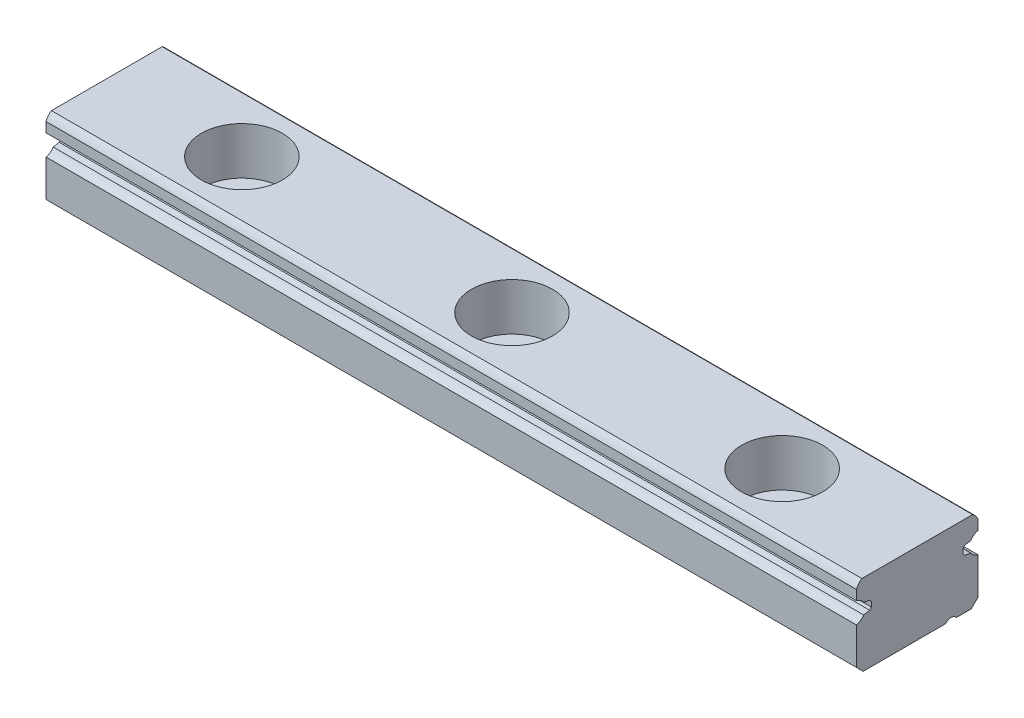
ISO-10303-21;
HEADER;
FILE_DESCRIPTION(('STEP AP214'),'2;1');
FILE_NAME('part.step','',(''),(''),'','','');
FILE_SCHEMA(('AUTOMOTIVE_DESIGN { 1 0 10303 214 1 1 1 1 }'));
ENDSEC;
DATA;
#1=APPLICATION_CONTEXT('core data for automotive mechanical design processes');
#2=APPLICATION_PROTOCOL_DEFINITION('international standard','automotive_design',2000,#1);
#3=PRODUCT_CONTEXT('',#1,'mechanical');
#4=PRODUCT('Part','Part','',(#3));
#5=PRODUCT_RELATED_PRODUCT_CATEGORY('part','',(#4));
#6=PRODUCT_DEFINITION_FORMATION('','',#4);
#7=PRODUCT_DEFINITION_CONTEXT('part definition',#1,'design');
#8=PRODUCT_DEFINITION('design','',#6,#7);
#9=PRODUCT_DEFINITION_SHAPE('','',#8);
#10=(LENGTH_UNIT() NAMED_UNIT(*) SI_UNIT(.MILLI.,.METRE.));
#11=(NAMED_UNIT(*) PLANE_ANGLE_UNIT() SI_UNIT($,.RADIAN.));
#12=(NAMED_UNIT(*) SI_UNIT($,.STERADIAN.) SOLID_ANGLE_UNIT());
#13=UNCERTAINTY_MEASURE_WITH_UNIT(LENGTH_MEASURE(1.E-05),#10,'distance_accuracy_value','');
#14=(GEOMETRIC_REPRESENTATION_CONTEXT(3) GLOBAL_UNCERTAINTY_ASSIGNED_CONTEXT((#13)) GLOBAL_UNIT_ASSIGNED_CONTEXT((#10,
#11,#12)) REPRESENTATION_CONTEXT('',''));
#15=CARTESIAN_POINT('',(0.,0.,0.));
#16=DIRECTION('',(0.,0.,1.));
#17=DIRECTION('',(1.,0.,0.));
#18=AXIS2_PLACEMENT_3D('',#15,#16,#17);
#19=CARTESIAN_POINT('',(-10.,4.17435595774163,-3.4));
#20=DIRECTION('',(0.,0.,-1.));
#21=DIRECTION('',(-1.,0.,0.));
#22=AXIS2_PLACEMENT_3D('',#19,#20,#21);
#23=PLANE('',#22);
#24=DIRECTION('',(0.,1.,0.));
#25=VECTOR('',#24,1.);
#26=CARTESIAN_POINT('',(-10.,4.17435595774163,-3.4));
#27=LINE('',#26,#25);
#28=CARTESIAN_POINT('',(-10.,3.82564404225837,-3.4));
#29=VERTEX_POINT('',#28);
#30=CARTESIAN_POINT('',(-10.,4.17435595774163,-3.4));
#31=VERTEX_POINT('',#30);
#32=EDGE_CURVE('E210',#29,#31,#27,.T.);
#33=ORIENTED_EDGE('',*,*,#32,.T.);
#34=DIRECTION('',(-1.,0.,0.));
#35=VECTOR('',#34,1.);
#36=CARTESIAN_POINT('',(-10.,4.17435595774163,-3.4));
#37=LINE('',#36,#35);
#38=CARTESIAN_POINT('',(50.,4.17435595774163,-3.4));
#39=VERTEX_POINT('',#38);
#40=EDGE_CURVE('E180',#31,#39,#37,.F.);
#41=ORIENTED_EDGE('',*,*,#40,.T.);
#42=DIRECTION('',(0.,1.,0.));
#43=VECTOR('',#42,1.);
#44=CARTESIAN_POINT('',(50.,4.17435595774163,-3.4));
#45=LINE('',#44,#43);
#46=CARTESIAN_POINT('',(50.,3.82564404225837,-3.4));
#47=VERTEX_POINT('',#46);
#48=EDGE_CURVE('E222',#39,#47,#45,.F.);
#49=ORIENTED_EDGE('',*,*,#48,.T.);
#50=DIRECTION('',(-1.,0.,0.));
#51=VECTOR('',#50,1.);
#52=CARTESIAN_POINT('',(-10.,3.82564404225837,-3.4));
#53=LINE('',#52,#51);
#54=EDGE_CURVE('E217',#47,#29,#53,.T.);
#55=ORIENTED_EDGE('',*,*,#54,.T.);
#56=EDGE_LOOP('',(#33,#41,#49,#55));
#57=FACE_BOUND('',#56,.T.);
#58=ADVANCED_FACE('F15',(#57),#23,.T.);
#59=CARTESIAN_POINT('',(-10.,3.82564404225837,3.4));
#60=DIRECTION('',(0.,0.,1.));
#61=DIRECTION('',(1.,0.,0.));
#62=AXIS2_PLACEMENT_3D('',#59,#60,#61);
#63=PLANE('',#62);
#64=DIRECTION('',(0.,1.,0.));
#65=VECTOR('',#64,1.);
#66=CARTESIAN_POINT('',(-10.,3.82564404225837,3.4));
#67=LINE('',#66,#65);
#68=CARTESIAN_POINT('',(-10.,4.17435595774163,3.4));
#69=VERTEX_POINT('',#68);
#70=CARTESIAN_POINT('',(-10.,3.82564404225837,3.4));
#71=VERTEX_POINT('',#70);
#72=EDGE_CURVE('E182',#69,#71,#67,.F.);
#73=ORIENTED_EDGE('',*,*,#72,.T.);
#74=DIRECTION('',(-1.,0.,0.));
#75=VECTOR('',#74,1.);
#76=CARTESIAN_POINT('',(-10.,3.82564404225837,3.4));
#77=LINE('',#76,#75);
#78=CARTESIAN_POINT('',(50.,3.82564404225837,3.4));
#79=VERTEX_POINT('',#78);
#80=EDGE_CURVE('E213',#71,#79,#77,.F.);
#81=ORIENTED_EDGE('',*,*,#80,.T.);
#82=DIRECTION('',(0.,1.,0.));
#83=VECTOR('',#82,1.);
#84=CARTESIAN_POINT('',(50.,3.82564404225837,3.4));
#85=LINE('',#84,#83);
#86=CARTESIAN_POINT('',(50.,4.17435595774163,3.4));
#87=VERTEX_POINT('',#86);
#88=EDGE_CURVE('E208',#79,#87,#85,.T.);
#89=ORIENTED_EDGE('',*,*,#88,.T.);
#90=DIRECTION('',(-1.,0.,0.));
#91=VECTOR('',#90,1.);
#92=CARTESIAN_POINT('',(-10.,4.17435595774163,3.4));
#93=LINE('',#92,#91);
#94=EDGE_CURVE('E203',#87,#69,#93,.T.);
#95=ORIENTED_EDGE('',*,*,#94,.T.);
#96=EDGE_LOOP('',(#73,#81,#89,#95));
#97=FACE_BOUND('',#96,.T.);
#98=ADVANCED_FACE('F928',(#97),#63,.T.);
#99=CARTESIAN_POINT('',(-10.,3.99999999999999,-3.76));
#100=DIRECTION('',(-1.,0.,0.));
#101=DIRECTION('',(0.,0.,1.));
#102=AXIS2_PLACEMENT_3D('',#99,#100,#101);
#103=CYLINDRICAL_SURFACE('',#102,0.400000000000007);
#104=ORIENTED_EDGE('',*,*,#40,.F.);
#105=CARTESIAN_POINT('',(-10.,3.99999999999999,-3.76));
#106=DIRECTION('',(-1.,0.,0.));
#107=DIRECTION('',(0.,0.,1.));
#108=AXIS2_PLACEMENT_3D('',#105,#106,#107);
#109=CIRCLE('',#108,0.400000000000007);
#110=CARTESIAN_POINT('',(-10.,4.32,-3.52));
#111=VERTEX_POINT('',#110);
#112=EDGE_CURVE('E19',#111,#31,#109,.F.);
#113=ORIENTED_EDGE('',*,*,#112,.F.);
#114=DIRECTION('',(1.,0.,0.));
#115=VECTOR('',#114,1.);
#116=CARTESIAN_POINT('',(-10.,4.32,-3.52));
#117=LINE('',#116,#115);
#118=CARTESIAN_POINT('',(50.,4.32,-3.52));
#119=VERTEX_POINT('',#118);
#120=EDGE_CURVE('E177',#119,#111,#117,.F.);
#121=ORIENTED_EDGE('',*,*,#120,.F.);
#122=CARTESIAN_POINT('',(50.,3.99999999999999,-3.76));
#123=DIRECTION('',(-1.,0.,0.));
#124=DIRECTION('',(0.,0.,1.));
#125=AXIS2_PLACEMENT_3D('',#122,#123,#124);
#126=CIRCLE('',#125,0.400000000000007);
#127=EDGE_CURVE('E221',#39,#119,#126,.T.);
#128=ORIENTED_EDGE('',*,*,#127,.F.);
#129=EDGE_LOOP('',(#104,#113,#121,#128));
#130=FACE_BOUND('',#129,.T.);
#131=ADVANCED_FACE('F174',(#130),#103,.F.);
#132=CARTESIAN_POINT('',(-10.,4.,-3.76));
#133=DIRECTION('',(-1.,0.,0.));
#134=DIRECTION('',(0.,0.,1.));
#135=AXIS2_PLACEMENT_3D('',#132,#133,#134);
#136=CYLINDRICAL_SURFACE('',#135,0.4);
#137=DIRECTION('',(1.,0.,0.));
#138=VECTOR('',#137,1.);
#139=CARTESIAN_POINT('',(-10.,3.68,-3.52));
#140=LINE('',#139,#138);
#141=CARTESIAN_POINT('',(-10.,3.68,-3.52));
#142=VERTEX_POINT('',#141);
#143=CARTESIAN_POINT('',(50.,3.68,-3.52));
#144=VERTEX_POINT('',#143);
#145=EDGE_CURVE('E201',#142,#144,#140,.T.);
#146=ORIENTED_EDGE('',*,*,#145,.F.);
#147=CARTESIAN_POINT('',(-10.,4.,-3.76));
#148=DIRECTION('',(-1.,0.,0.));
#149=DIRECTION('',(0.,0.,1.));
#150=AXIS2_PLACEMENT_3D('',#147,#148,#149);
#151=CIRCLE('',#150,0.4);
#152=EDGE_CURVE('E220',#29,#142,#151,.F.);
#153=ORIENTED_EDGE('',*,*,#152,.F.);
#154=ORIENTED_EDGE('',*,*,#54,.F.);
#155=CARTESIAN_POINT('',(50.,4.,-3.76));
#156=DIRECTION('',(-1.,0.,0.));
#157=DIRECTION('',(0.,0.,1.));
#158=AXIS2_PLACEMENT_3D('',#155,#156,#157);
#159=CIRCLE('',#158,0.4);
#160=EDGE_CURVE('E316',#144,#47,#159,.T.);
#161=ORIENTED_EDGE('',*,*,#160,.F.);
#162=EDGE_LOOP('',(#146,#153,#154,#161));
#163=FACE_BOUND('',#162,.T.);
#164=ADVANCED_FACE('F332',(#163),#136,.F.);
#165=CARTESIAN_POINT('',(-10.,3.99999999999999,3.75999999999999));
#166=DIRECTION('',(-1.,0.,0.));
#167=DIRECTION('',(0.,0.,1.));
#168=AXIS2_PLACEMENT_3D('',#165,#166,#167);
#169=CYLINDRICAL_SURFACE('',#168,0.399999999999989);
#170=ORIENTED_EDGE('',*,*,#80,.F.);
#171=CARTESIAN_POINT('',(-10.,3.99999999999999,3.75999999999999));
#172=DIRECTION('',(-1.,0.,0.));
#173=DIRECTION('',(0.,0.,1.));
#174=AXIS2_PLACEMENT_3D('',#171,#172,#173);
#175=CIRCLE('',#174,0.399999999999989);
#176=CARTESIAN_POINT('',(-10.,3.68,3.52));
#177=VERTEX_POINT('',#176);
#178=EDGE_CURVE('E216',#177,#71,#175,.F.);
#179=ORIENTED_EDGE('',*,*,#178,.F.);
#180=DIRECTION('',(1.,0.,0.));
#181=VECTOR('',#180,1.);
#182=CARTESIAN_POINT('',(-10.,3.68,3.52));
#183=LINE('',#182,#181);
#184=CARTESIAN_POINT('',(50.,3.68,3.52));
#185=VERTEX_POINT('',#184);
#186=EDGE_CURVE('E351',#185,#177,#183,.F.);
#187=ORIENTED_EDGE('',*,*,#186,.F.);
#188=CARTESIAN_POINT('',(50.,3.99999999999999,3.75999999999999));
#189=DIRECTION('',(-1.,0.,0.));
#190=DIRECTION('',(0.,0.,1.));
#191=AXIS2_PLACEMENT_3D('',#188,#189,#190);
#192=CIRCLE('',#191,0.399999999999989);
#193=EDGE_CURVE('E207',#79,#185,#192,.T.);
#194=ORIENTED_EDGE('',*,*,#193,.F.);
#195=EDGE_LOOP('',(#170,#179,#187,#194));
#196=FACE_BOUND('',#195,.T.);
#197=ADVANCED_FACE('F901',(#196),#169,.F.);
#198=CARTESIAN_POINT('',(-10.,3.99999999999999,3.76));
#199=DIRECTION('',(-1.,0.,0.));
#200=DIRECTION('',(0.,0.,1.));
#201=AXIS2_PLACEMENT_3D('',#198,#199,#200);
#202=CYLINDRICAL_SURFACE('',#201,0.400000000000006);
#203=DIRECTION('',(1.,0.,0.));
#204=VECTOR('',#203,1.);
#205=CARTESIAN_POINT('',(-10.,4.32,3.52));
#206=LINE('',#205,#204);
#207=CARTESIAN_POINT('',(-10.,4.32,3.52));
#208=VERTEX_POINT('',#207);
#209=CARTESIAN_POINT('',(50.,4.32,3.52));
#210=VERTEX_POINT('',#209);
#211=EDGE_CURVE('E310',#208,#210,#206,.T.);
#212=ORIENTED_EDGE('',*,*,#211,.F.);
#213=CARTESIAN_POINT('',(-10.,3.99999999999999,3.76));
#214=DIRECTION('',(-1.,0.,0.));
#215=DIRECTION('',(0.,0.,1.));
#216=AXIS2_PLACEMENT_3D('',#213,#214,#215);
#217=CIRCLE('',#216,0.400000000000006);
#218=EDGE_CURVE('E206',#69,#208,#217,.F.);
#219=ORIENTED_EDGE('',*,*,#218,.F.);
#220=ORIENTED_EDGE('',*,*,#94,.F.);
#221=CARTESIAN_POINT('',(50.,3.99999999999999,3.76));
#222=DIRECTION('',(-1.,0.,0.));
#223=DIRECTION('',(0.,0.,1.));
#224=AXIS2_PLACEMENT_3D('',#221,#222,#223);
#225=CIRCLE('',#224,0.400000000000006);
#226=EDGE_CURVE('E197',#210,#87,#225,.T.);
#227=ORIENTED_EDGE('',*,*,#226,.F.);
#228=EDGE_LOOP('',(#212,#219,#220,#227));
#229=FACE_BOUND('',#228,.T.);
#230=ADVANCED_FACE('F892',(#229),#202,.F.);
#231=CARTESIAN_POINT('',(-10.,4.4,-3.96875114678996));
#232=DIRECTION('',(0.,-0.984478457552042,-0.175505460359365));
#233=DIRECTION('',(0.,0.175505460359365,-0.984478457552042));
#234=AXIS2_PLACEMENT_3D('',#231,#232,#233);
#235=PLANE('',#234);
#236=DIRECTION('',(0.,0.175505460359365,-0.984478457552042));
#237=VECTOR('',#236,1.);
#238=CARTESIAN_POINT('',(-10.,4.4,-3.96875114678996));
#239=LINE('',#238,#237);
#240=CARTESIAN_POINT('',(-10.,4.4,-3.96875114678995));
#241=VERTEX_POINT('',#240);
#242=EDGE_CURVE('E184',#111,#241,#239,.T.);
#243=ORIENTED_EDGE('',*,*,#242,.T.);
#244=DIRECTION('',(-1.,0.,0.));
#245=VECTOR('',#244,1.);
#246=CARTESIAN_POINT('',(-10.,4.4,-3.96875114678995));
#247=LINE('',#246,#245);
#248=CARTESIAN_POINT('',(50.,4.4,-3.96875114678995));
#249=VERTEX_POINT('',#248);
#250=EDGE_CURVE('E308',#241,#249,#247,.F.);
#251=ORIENTED_EDGE('',*,*,#250,.T.);
#252=DIRECTION('',(0.,0.175505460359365,-0.984478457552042));
#253=VECTOR('',#252,1.);
#254=CARTESIAN_POINT('',(50.,4.4,-3.96875114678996));
#255=LINE('',#254,#253);
#256=EDGE_CURVE('E195',#249,#119,#255,.F.);
#257=ORIENTED_EDGE('',*,*,#256,.T.);
#258=ORIENTED_EDGE('',*,*,#120,.T.);
#259=EDGE_LOOP('',(#243,#251,#257,#258));
#260=FACE_BOUND('',#259,.T.);
#261=ADVANCED_FACE('F194',(#260),#235,.T.);
#262=CARTESIAN_POINT('',(-10.,3.68,-3.52));
#263=DIRECTION('',(0.,0.984478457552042,-0.175505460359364));
#264=DIRECTION('',(0.,0.175505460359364,0.984478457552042));
#265=AXIS2_PLACEMENT_3D('',#262,#263,#264);
#266=PLANE('',#265);
#267=DIRECTION('',(0.,0.175505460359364,0.984478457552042));
#268=VECTOR('',#267,1.);
#269=CARTESIAN_POINT('',(-10.,3.68,-3.52));
#270=LINE('',#269,#268);
#271=CARTESIAN_POINT('',(-10.,3.6,-3.96875114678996));
#272=VERTEX_POINT('',#271);
#273=EDGE_CURVE('E328',#272,#142,#270,.T.);
#274=ORIENTED_EDGE('',*,*,#273,.T.);
#275=ORIENTED_EDGE('',*,*,#145,.T.);
#276=DIRECTION('',(0.,0.175505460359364,0.984478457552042));
#277=VECTOR('',#276,1.);
#278=CARTESIAN_POINT('',(50.,3.68,-3.52));
#279=LINE('',#278,#277);
#280=CARTESIAN_POINT('',(50.,3.6,-3.96875114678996));
#281=VERTEX_POINT('',#280);
#282=EDGE_CURVE('E192',#144,#281,#279,.F.);
#283=ORIENTED_EDGE('',*,*,#282,.T.);
#284=DIRECTION('',(-1.,0.,0.));
#285=VECTOR('',#284,1.);
#286=CARTESIAN_POINT('',(-10.,3.6,-3.96875114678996));
#287=LINE('',#286,#285);
#288=EDGE_CURVE('E304',#281,#272,#287,.T.);
#289=ORIENTED_EDGE('',*,*,#288,.T.);
#290=EDGE_LOOP('',(#274,#275,#283,#289));
#291=FACE_BOUND('',#290,.T.);
#292=ADVANCED_FACE('F335',(#291),#266,.T.);
#293=CARTESIAN_POINT('',(-10.,3.6,3.96875114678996));
#294=DIRECTION('',(0.,0.984478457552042,0.175505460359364));
#295=DIRECTION('',(0.,-0.175505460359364,0.984478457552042));
#296=AXIS2_PLACEMENT_3D('',#293,#294,#295);
#297=PLANE('',#296);
#298=DIRECTION('',(0.,-0.175505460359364,0.984478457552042));
#299=VECTOR('',#298,1.);
#300=CARTESIAN_POINT('',(-10.,3.6,3.96875114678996));
#301=LINE('',#300,#299);
#302=CARTESIAN_POINT('',(-10.,3.6,3.96875114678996));
#303=VERTEX_POINT('',#302);
#304=EDGE_CURVE('E353',#177,#303,#301,.T.);
#305=ORIENTED_EDGE('',*,*,#304,.T.);
#306=DIRECTION('',(-1.,0.,0.));
#307=VECTOR('',#306,1.);
#308=CARTESIAN_POINT('',(-10.,3.6,3.96875114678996));
#309=LINE('',#308,#307);
#310=CARTESIAN_POINT('',(50.,3.6,3.96875114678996));
#311=VERTEX_POINT('',#310);
#312=EDGE_CURVE('E296',#303,#311,#309,.F.);
#313=ORIENTED_EDGE('',*,*,#312,.T.);
#314=DIRECTION('',(0.,-0.175505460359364,0.984478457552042));
#315=VECTOR('',#314,1.);
#316=CARTESIAN_POINT('',(50.,3.6,3.96875114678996));
#317=LINE('',#316,#315);
#318=EDGE_CURVE('E334',#311,#185,#317,.F.);
#319=ORIENTED_EDGE('',*,*,#318,.T.);
#320=ORIENTED_EDGE('',*,*,#186,.T.);
#321=EDGE_LOOP('',(#305,#313,#319,#320));
#322=FACE_BOUND('',#321,.T.);
#323=ADVANCED_FACE('F867',(#322),#297,.T.);
#324=CARTESIAN_POINT('',(-10.,0.,-4.));
#325=DIRECTION('',(0.,-1.,0.));
#326=DIRECTION('',(0.,0.,-1.));
#327=AXIS2_PLACEMENT_3D('',#324,#325,#326);
#328=PLANE('',#327);
#329=DIRECTION('',(1.,0.,0.));
#330=VECTOR('',#329,1.);
#331=CARTESIAN_POINT('',(-10.,0.,-4.));
#332=LINE('',#331,#330);
#333=CARTESIAN_POINT('',(50.,0.,-4.));
#334=VERTEX_POINT('',#333);
#335=CARTESIAN_POINT('',(-10.,0.,-4.));
#336=VERTEX_POINT('',#335);
#337=EDGE_CURVE('E342',#334,#336,#332,.F.);
#338=ORIENTED_EDGE('',*,*,#337,.F.);
#339=DIRECTION('',(0.,0.,-1.));
#340=VECTOR('',#339,1.);
#341=CARTESIAN_POINT('',(50.,0.,-4.));
#342=LINE('',#341,#340);
#343=CARTESIAN_POINT('',(50.,0.,-2.9));
#344=VERTEX_POINT('',#343);
#345=EDGE_CURVE('E381',#334,#344,#342,.F.);
#346=ORIENTED_EDGE('',*,*,#345,.T.);
#347=DIRECTION('',(-1.,0.,0.));
#348=VECTOR('',#347,1.);
#349=CARTESIAN_POINT('',(-10.,0.,-2.9));
#350=LINE('',#349,#348);
#351=CARTESIAN_POINT('',(-10.,0.,-2.9));
#352=VERTEX_POINT('',#351);
#353=EDGE_CURVE('E291',#344,#352,#350,.T.);
#354=ORIENTED_EDGE('',*,*,#353,.T.);
#355=DIRECTION('',(0.,0.,-1.));
#356=VECTOR('',#355,1.);
#357=CARTESIAN_POINT('',(-10.,0.,-4.));
#358=LINE('',#357,#356);
#359=EDGE_CURVE('E358',#352,#336,#358,.T.);
#360=ORIENTED_EDGE('',*,*,#359,.T.);
#361=EDGE_LOOP('',(#338,#346,#354,#360));
#362=FACE_BOUND('',#361,.T.);
#363=ADVANCED_FACE('F405',(#362),#328,.T.);
#364=CARTESIAN_POINT('',(-10.,4.32,3.52));
#365=DIRECTION('',(0.,-0.984478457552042,0.175505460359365));
#366=DIRECTION('',(0.,-0.175505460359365,-0.984478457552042));
#367=AXIS2_PLACEMENT_3D('',#364,#365,#366);
#368=PLANE('',#367);
#369=DIRECTION('',(0.,-0.175505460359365,-0.984478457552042));
#370=VECTOR('',#369,1.);
#371=CARTESIAN_POINT('',(-10.,4.32,3.52));
#372=LINE('',#371,#370);
#373=CARTESIAN_POINT('',(-10.,4.4,3.96875114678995));
#374=VERTEX_POINT('',#373);
#375=EDGE_CURVE('E350',#374,#208,#372,.T.);
#376=ORIENTED_EDGE('',*,*,#375,.T.);
#377=ORIENTED_EDGE('',*,*,#211,.T.);
#378=DIRECTION('',(0.,-0.175505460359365,-0.984478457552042));
#379=VECTOR('',#378,1.);
#380=CARTESIAN_POINT('',(50.,4.32,3.52));
#381=LINE('',#380,#379);
#382=CARTESIAN_POINT('',(50.,4.4,3.96875114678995));
#383=VERTEX_POINT('',#382);
#384=EDGE_CURVE('E379',#210,#383,#381,.F.);
#385=ORIENTED_EDGE('',*,*,#384,.T.);
#386=DIRECTION('',(-1.,0.,0.));
#387=VECTOR('',#386,1.);
#388=CARTESIAN_POINT('',(-10.,4.4,3.96875114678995));
#389=LINE('',#388,#387);
#390=EDGE_CURVE('E287',#383,#374,#389,.T.);
#391=ORIENTED_EDGE('',*,*,#390,.T.);
#392=EDGE_LOOP('',(#376,#377,#385,#391));
#393=FACE_BOUND('',#392,.T.);
#394=ADVANCED_FACE('F848',(#393),#368,.T.);
#395=CARTESIAN_POINT('',(20.,1.35,0.));
#396=DIRECTION('',(0.,-1.,0.));
#397=DIRECTION('',(0.,0.,-1.));
#398=AXIS2_PLACEMENT_3D('',#395,#396,#397);
#399=CYLINDRICAL_SURFACE('',#398,1.75);
#400=CARTESIAN_POINT('',(20.,2.5,0.));
#401=DIRECTION('',(0.,-1.,0.));
#402=DIRECTION('',(0.,0.,-1.));
#403=AXIS2_PLACEMENT_3D('',#400,#401,#402);
#404=CIRCLE('',#403,1.75);
#405=CARTESIAN_POINT('',(20.,2.5,-1.75));
#406=VERTEX_POINT('',#405);
#407=EDGE_CURVE('E279',#406,#406,#404,.F.);
#408=ORIENTED_EDGE('',*,*,#407,.T.);
#409=EDGE_LOOP('',(#408));
#410=FACE_BOUND('',#409,.T.);
#411=CARTESIAN_POINT('',(20.,0.200000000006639,0.));
#412=DIRECTION('',(0.,-1.,0.));
#413=DIRECTION('',(0.,0.,-1.));
#414=AXIS2_PLACEMENT_3D('',#411,#412,#413);
#415=CIRCLE('',#414,1.74999999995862);
#416=CARTESIAN_POINT('',(20.,0.200000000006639,-1.74999999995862));
#417=VERTEX_POINT('',#416);
#418=EDGE_CURVE('E378',#417,#417,#415,.T.);
#419=ORIENTED_EDGE('',*,*,#418,.T.);
#420=EDGE_LOOP('',(#419));
#421=FACE_BOUND('',#420,.T.);
#422=ADVANCED_FACE('F838',(#410,#421),#399,.F.);
#423=CARTESIAN_POINT('',(40.,1.35,0.));
#424=DIRECTION('',(0.,-1.,0.));
#425=DIRECTION('',(0.,0.,-1.));
#426=AXIS2_PLACEMENT_3D('',#423,#424,#425);
#427=CYLINDRICAL_SURFACE('',#426,1.75);
#428=CARTESIAN_POINT('',(40.,2.5,0.));
#429=DIRECTION('',(0.,-1.,0.));
#430=DIRECTION('',(0.,0.,-1.));
#431=AXIS2_PLACEMENT_3D('',#428,#429,#430);
#432=CIRCLE('',#431,1.75);
#433=CARTESIAN_POINT('',(40.,2.5,-1.75));
#434=VERTEX_POINT('',#433);
#435=EDGE_CURVE('E276',#434,#434,#432,.F.);
#436=ORIENTED_EDGE('',*,*,#435,.T.);
#437=EDGE_LOOP('',(#436));
#438=FACE_BOUND('',#437,.T.);
#439=CARTESIAN_POINT('',(40.,0.200000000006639,0.));
#440=DIRECTION('',(0.,-1.,0.));
#441=DIRECTION('',(0.,0.,-1.));
#442=AXIS2_PLACEMENT_3D('',#439,#440,#441);
#443=CIRCLE('',#442,1.74999999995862);
#444=CARTESIAN_POINT('',(40.,0.200000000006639,-1.74999999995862));
#445=VERTEX_POINT('',#444);
#446=EDGE_CURVE('E386',#445,#445,#443,.T.);
#447=ORIENTED_EDGE('',*,*,#446,.T.);
#448=EDGE_LOOP('',(#447));
#449=FACE_BOUND('',#448,.T.);
#450=ADVANCED_FACE('F535',(#438,#449),#427,.F.);
#451=CARTESIAN_POINT('',(0.,1.35,0.));
#452=DIRECTION('',(0.,-1.,0.));
#453=DIRECTION('',(0.,0.,-1.));
#454=AXIS2_PLACEMENT_3D('',#451,#452,#453);
#455=CYLINDRICAL_SURFACE('',#454,1.75);
#456=CARTESIAN_POINT('',(0.,2.5,0.));
#457=DIRECTION('',(0.,-1.,0.));
#458=DIRECTION('',(0.,0.,-1.));
#459=AXIS2_PLACEMENT_3D('',#456,#457,#458);
#460=CIRCLE('',#459,1.75);
#461=CARTESIAN_POINT('',(0.,2.5,-1.75));
#462=VERTEX_POINT('',#461);
#463=EDGE_CURVE('E272',#462,#462,#460,.F.);
#464=ORIENTED_EDGE('',*,*,#463,.T.);
#465=EDGE_LOOP('',(#464));
#466=FACE_BOUND('',#465,.T.);
#467=CARTESIAN_POINT('',(0.,0.200000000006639,0.));
#468=DIRECTION('',(0.,-1.,0.));
#469=DIRECTION('',(0.,0.,-1.));
#470=AXIS2_PLACEMENT_3D('',#467,#468,#469);
#471=CIRCLE('',#470,1.74999999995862);
#472=CARTESIAN_POINT('',(0.,0.200000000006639,-1.74999999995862));
#473=VERTEX_POINT('',#472);
#474=EDGE_CURVE('E389',#473,#473,#471,.T.);
#475=ORIENTED_EDGE('',*,*,#474,.T.);
#476=EDGE_LOOP('',(#475));
#477=FACE_BOUND('',#476,.T.);
#478=ADVANCED_FACE('F526',(#466,#477),#455,.F.);
#479=CARTESIAN_POINT('',(-10.,4.,-4.65));
#480=DIRECTION('',(-1.,0.,0.));
#481=DIRECTION('',(0.,0.,1.));
#482=AXIS2_PLACEMENT_3D('',#479,#480,#481);
#483=CYLINDRICAL_SURFACE('',#482,0.790000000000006);
#484=ORIENTED_EDGE('',*,*,#250,.F.);
#485=CARTESIAN_POINT('',(-10.,4.,-4.65));
#486=DIRECTION('',(-1.,0.,0.));
#487=DIRECTION('',(0.,0.,1.));
#488=AXIS2_PLACEMENT_3D('',#485,#486,#487);
#489=CIRCLE('',#488,0.790000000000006);
#490=CARTESIAN_POINT('',(-10.,4.77562877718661,-4.5));
#491=VERTEX_POINT('',#490);
#492=EDGE_CURVE('E188',#491,#241,#489,.F.);
#493=ORIENTED_EDGE('',*,*,#492,.F.);
#494=DIRECTION('',(-1.,0.,0.));
#495=VECTOR('',#494,1.);
#496=CARTESIAN_POINT('',(-10.,4.77562877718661,-4.5));
#497=LINE('',#496,#495);
#498=CARTESIAN_POINT('',(50.,4.77562877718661,-4.5));
#499=VERTEX_POINT('',#498);
#500=EDGE_CURVE('E275',#499,#491,#497,.T.);
#501=ORIENTED_EDGE('',*,*,#500,.F.);
#502=CARTESIAN_POINT('',(50.,4.,-4.65));
#503=DIRECTION('',(-1.,0.,0.));
#504=DIRECTION('',(0.,0.,1.));
#505=AXIS2_PLACEMENT_3D('',#502,#503,#504);
#506=CIRCLE('',#505,0.790000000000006);
#507=EDGE_CURVE('E305',#249,#499,#506,.T.);
#508=ORIENTED_EDGE('',*,*,#507,.F.);
#509=EDGE_LOOP('',(#484,#493,#501,#508));
#510=FACE_BOUND('',#509,.T.);
#511=ADVANCED_FACE('F524',(#510),#483,.F.);
#512=CARTESIAN_POINT('',(-10.,0.5,-4.5));
#513=DIRECTION('',(0.,-0.707106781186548,-0.707106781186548));
#514=DIRECTION('',(0.,0.707106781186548,-0.707106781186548));
#515=AXIS2_PLACEMENT_3D('',#512,#513,#514);
#516=PLANE('',#515);
#517=DIRECTION('',(0.,0.707106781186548,-0.707106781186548));
#518=VECTOR('',#517,1.);
#519=CARTESIAN_POINT('',(-10.,0.5,-4.5));
#520=LINE('',#519,#518);
#521=CARTESIAN_POINT('',(-10.,0.5,-4.5));
#522=VERTEX_POINT('',#521);
#523=EDGE_CURVE('E345',#336,#522,#520,.T.);
#524=ORIENTED_EDGE('',*,*,#523,.T.);
#525=DIRECTION('',(-1.,0.,0.));
#526=VECTOR('',#525,1.);
#527=CARTESIAN_POINT('',(-10.,0.5,-4.5));
#528=LINE('',#527,#526);
#529=CARTESIAN_POINT('',(50.,0.5,-4.5));
#530=VERTEX_POINT('',#529);
#531=EDGE_CURVE('E458',#530,#522,#528,.T.);
#532=ORIENTED_EDGE('',*,*,#531,.F.);
#533=DIRECTION('',(0.,0.707106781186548,-0.707106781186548));
#534=VECTOR('',#533,1.);
#535=CARTESIAN_POINT('',(50.,0.5,-4.5));
#536=LINE('',#535,#534);
#537=EDGE_CURVE('E307',#530,#334,#536,.F.);
#538=ORIENTED_EDGE('',*,*,#537,.T.);
#539=ORIENTED_EDGE('',*,*,#337,.T.);
#540=EDGE_LOOP('',(#524,#532,#538,#539));
#541=FACE_BOUND('',#540,.T.);
#542=ADVANCED_FACE('F470',(#541),#516,.T.);
#543=CARTESIAN_POINT('',(-10.,4.,-4.65));
#544=DIRECTION('',(-1.,0.,0.));
#545=DIRECTION('',(0.,0.,1.));
#546=AXIS2_PLACEMENT_3D('',#543,#544,#545);
#547=CYLINDRICAL_SURFACE('',#546,0.789999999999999);
#548=DIRECTION('',(-1.,0.,0.));
#549=VECTOR('',#548,1.);
#550=CARTESIAN_POINT('',(-10.,3.22437122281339,-4.5));
#551=LINE('',#550,#549);
#552=CARTESIAN_POINT('',(-10.,3.22437122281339,-4.5));
#553=VERTEX_POINT('',#552);
#554=CARTESIAN_POINT('',(50.,3.22437122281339,-4.5));
#555=VERTEX_POINT('',#554);
#556=EDGE_CURVE('E448',#553,#555,#551,.F.);
#557=ORIENTED_EDGE('',*,*,#556,.F.);
#558=CARTESIAN_POINT('',(-10.,4.,-4.65));
#559=DIRECTION('',(-1.,0.,0.));
#560=DIRECTION('',(0.,0.,1.));
#561=AXIS2_PLACEMENT_3D('',#558,#559,#560);
#562=CIRCLE('',#561,0.789999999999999);
#563=EDGE_CURVE('E302',#272,#553,#562,.F.);
#564=ORIENTED_EDGE('',*,*,#563,.F.);
#565=ORIENTED_EDGE('',*,*,#288,.F.);
#566=CARTESIAN_POINT('',(50.,4.,-4.65));
#567=DIRECTION('',(-1.,0.,0.));
#568=DIRECTION('',(0.,0.,1.));
#569=AXIS2_PLACEMENT_3D('',#566,#567,#568);
#570=CIRCLE('',#569,0.789999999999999);
#571=EDGE_CURVE('E299',#555,#281,#570,.T.);
#572=ORIENTED_EDGE('',*,*,#571,.F.);
#573=EDGE_LOOP('',(#557,#564,#565,#572));
#574=FACE_BOUND('',#573,.T.);
#575=ADVANCED_FACE('F533',(#574),#547,.F.);
#576=CARTESIAN_POINT('',(-10.,4.,4.65));
#577=DIRECTION('',(-1.,0.,0.));
#578=DIRECTION('',(0.,0.,1.));
#579=AXIS2_PLACEMENT_3D('',#576,#577,#578);
#580=CYLINDRICAL_SURFACE('',#579,0.789999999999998);
#581=ORIENTED_EDGE('',*,*,#312,.F.);
#582=CARTESIAN_POINT('',(-10.,4.,4.65));
#583=DIRECTION('',(-1.,0.,0.));
#584=DIRECTION('',(0.,0.,1.));
#585=AXIS2_PLACEMENT_3D('',#582,#583,#584);
#586=CIRCLE('',#585,0.789999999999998);
#587=CARTESIAN_POINT('',(-10.,3.22437122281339,4.5));
#588=VERTEX_POINT('',#587);
#589=EDGE_CURVE('E297',#588,#303,#586,.F.);
#590=ORIENTED_EDGE('',*,*,#589,.F.);
#591=DIRECTION('',(1.,0.,0.));
#592=VECTOR('',#591,1.);
#593=CARTESIAN_POINT('',(-10.,3.22437122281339,4.5));
#594=LINE('',#593,#592);
#595=CARTESIAN_POINT('',(50.,3.22437122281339,4.5));
#596=VERTEX_POINT('',#595);
#597=EDGE_CURVE('E445',#596,#588,#594,.F.);
#598=ORIENTED_EDGE('',*,*,#597,.F.);
#599=CARTESIAN_POINT('',(50.,4.,4.65));
#600=DIRECTION('',(-1.,0.,0.));
#601=DIRECTION('',(0.,0.,1.));
#602=AXIS2_PLACEMENT_3D('',#599,#600,#601);
#603=CIRCLE('',#602,0.789999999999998);
#604=EDGE_CURVE('E294',#311,#596,#603,.T.);
#605=ORIENTED_EDGE('',*,*,#604,.F.);
#606=EDGE_LOOP('',(#581,#590,#598,#605));
#607=FACE_BOUND('',#606,.T.);
#608=ADVANCED_FACE('F609',(#607),#580,.F.);
#609=CARTESIAN_POINT('',(-10.,-0.3,-2.5));
#610=DIRECTION('',(-1.,0.,0.));
#611=DIRECTION('',(0.,0.,1.));
#612=AXIS2_PLACEMENT_3D('',#609,#610,#611);
#613=CYLINDRICAL_SURFACE('',#612,0.5);
#614=CARTESIAN_POINT('',(-10.,-0.3,-2.5));
#615=DIRECTION('',(-1.,0.,0.));
#616=DIRECTION('',(0.,0.,1.));
#617=AXIS2_PLACEMENT_3D('',#614,#615,#616);
#618=CIRCLE('',#617,0.5);
#619=CARTESIAN_POINT('',(-10.,0.,-2.1));
#620=VERTEX_POINT('',#619);
#621=EDGE_CURVE('E288',#352,#620,#618,.F.);
#622=ORIENTED_EDGE('',*,*,#621,.F.);
#623=ORIENTED_EDGE('',*,*,#353,.F.);
#624=CARTESIAN_POINT('',(50.,-0.3,-2.5));
#625=DIRECTION('',(-1.,0.,0.));
#626=DIRECTION('',(0.,0.,1.));
#627=AXIS2_PLACEMENT_3D('',#624,#625,#626);
#628=CIRCLE('',#627,0.5);
#629=CARTESIAN_POINT('',(50.,0.,-2.1));
#630=VERTEX_POINT('',#629);
#631=EDGE_CURVE('E292',#630,#344,#628,.T.);
#632=ORIENTED_EDGE('',*,*,#631,.F.);
#633=DIRECTION('',(1.,0.,0.));
#634=VECTOR('',#633,1.);
#635=CARTESIAN_POINT('',(-10.,0.,-2.1));
#636=LINE('',#635,#634);
#637=EDGE_CURVE('E413',#620,#630,#636,.T.);
#638=ORIENTED_EDGE('',*,*,#637,.F.);
#639=EDGE_LOOP('',(#622,#623,#632,#638));
#640=FACE_BOUND('',#639,.T.);
#641=ADVANCED_FACE('F410',(#640),#613,.F.);
#642=CARTESIAN_POINT('',(-10.,0.,4.));
#643=DIRECTION('',(0.,-0.707106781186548,0.707106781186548));
#644=DIRECTION('',(0.,-0.707106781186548,-0.707106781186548));
#645=AXIS2_PLACEMENT_3D('',#642,#643,#644);
#646=PLANE('',#645);
#647=DIRECTION('',(0.,-0.707106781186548,-0.707106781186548));
#648=VECTOR('',#647,1.);
#649=CARTESIAN_POINT('',(-10.,0.,4.));
#650=LINE('',#649,#648);
#651=CARTESIAN_POINT('',(-10.,0.5,4.5));
#652=VERTEX_POINT('',#651);
#653=CARTESIAN_POINT('',(-10.,0.,4.));
#654=VERTEX_POINT('',#653);
#655=EDGE_CURVE('E392',#652,#654,#650,.T.);
#656=ORIENTED_EDGE('',*,*,#655,.T.);
#657=DIRECTION('',(1.,0.,0.));
#658=VECTOR('',#657,1.);
#659=CARTESIAN_POINT('',(-10.,0.,4.));
#660=LINE('',#659,#658);
#661=CARTESIAN_POINT('',(50.,0.,4.));
#662=VERTEX_POINT('',#661);
#663=EDGE_CURVE('E271',#662,#654,#660,.F.);
#664=ORIENTED_EDGE('',*,*,#663,.F.);
#665=DIRECTION('',(0.,-0.707106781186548,-0.707106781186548));
#666=VECTOR('',#665,1.);
#667=CARTESIAN_POINT('',(50.,0.,4.));
#668=LINE('',#667,#666);
#669=CARTESIAN_POINT('',(50.,0.5,4.5));
#670=VERTEX_POINT('',#669);
#671=EDGE_CURVE('E290',#662,#670,#668,.F.);
#672=ORIENTED_EDGE('',*,*,#671,.T.);
#673=DIRECTION('',(1.,0.,0.));
#674=VECTOR('',#673,1.);
#675=CARTESIAN_POINT('',(-10.,0.5,4.5));
#676=LINE('',#675,#674);
#677=EDGE_CURVE('E432',#652,#670,#676,.T.);
#678=ORIENTED_EDGE('',*,*,#677,.F.);
#679=EDGE_LOOP('',(#656,#664,#672,#678));
#680=FACE_BOUND('',#679,.T.);
#681=ADVANCED_FACE('F429',(#680),#646,.T.);
#682=CARTESIAN_POINT('',(0.,-5.6843418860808E-11,0.));
#683=DIRECTION('',(0.,-1.,0.));
#684=DIRECTION('',(0.,0.,-1.));
#685=AXIS2_PLACEMENT_3D('',#682,#683,#684);
#686=CONICAL_SURFACE('',#685,1.9500000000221,0.785398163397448);
#687=CARTESIAN_POINT('',(0.,-5.6843418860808E-11,0.));
#688=DIRECTION('',(0.,-1.,0.));
#689=DIRECTION('',(0.,0.,-1.));
#690=AXIS2_PLACEMENT_3D('',#687,#688,#689);
#691=CIRCLE('',#690,1.9500000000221);
#692=CARTESIAN_POINT('',(0.,-5.6843418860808E-11,-1.9500000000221));
#693=VERTEX_POINT('',#692);
#694=EDGE_CURVE('E268',#693,#693,#691,.F.);
#695=ORIENTED_EDGE('',*,*,#694,.F.);
#696=EDGE_LOOP('',(#695));
#697=FACE_BOUND('',#696,.T.);
#698=ORIENTED_EDGE('',*,*,#474,.F.);
#699=EDGE_LOOP('',(#698));
#700=FACE_BOUND('',#699,.T.);
#701=ADVANCED_FACE('F600',(#697,#700),#686,.F.);
#702=CARTESIAN_POINT('',(40.,-5.6843418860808E-11,0.));
#703=DIRECTION('',(0.,-1.,0.));
#704=DIRECTION('',(0.,0.,-1.));
#705=AXIS2_PLACEMENT_3D('',#702,#703,#704);
#706=CONICAL_SURFACE('',#705,1.9500000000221,0.785398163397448);
#707=CARTESIAN_POINT('',(40.,-5.6843418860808E-11,0.));
#708=DIRECTION('',(0.,-1.,0.));
#709=DIRECTION('',(0.,0.,-1.));
#710=AXIS2_PLACEMENT_3D('',#707,#708,#709);
#711=CIRCLE('',#710,1.9500000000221);
#712=CARTESIAN_POINT('',(40.,-5.6843418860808E-11,-1.9500000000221));
#713=VERTEX_POINT('',#712);
#714=EDGE_CURVE('E265',#713,#713,#711,.F.);
#715=ORIENTED_EDGE('',*,*,#714,.F.);
#716=EDGE_LOOP('',(#715));
#717=FACE_BOUND('',#716,.T.);
#718=ORIENTED_EDGE('',*,*,#446,.F.);
#719=EDGE_LOOP('',(#718));
#720=FACE_BOUND('',#719,.T.);
#721=ADVANCED_FACE('F596',(#717,#720),#706,.F.);
#722=CARTESIAN_POINT('',(20.,-5.6843418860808E-11,0.));
#723=DIRECTION('',(0.,-1.,0.));
#724=DIRECTION('',(0.,0.,-1.));
#725=AXIS2_PLACEMENT_3D('',#722,#723,#724);
#726=CONICAL_SURFACE('',#725,1.9500000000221,0.785398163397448);
#727=CARTESIAN_POINT('',(20.,-5.6843418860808E-11,0.));
#728=DIRECTION('',(0.,-1.,0.));
#729=DIRECTION('',(0.,0.,-1.));
#730=AXIS2_PLACEMENT_3D('',#727,#728,#729);
#731=CIRCLE('',#730,1.9500000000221);
#732=CARTESIAN_POINT('',(20.,-5.6843418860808E-11,-1.9500000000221));
#733=VERTEX_POINT('',#732);
#734=EDGE_CURVE('E262',#733,#733,#731,.F.);
#735=ORIENTED_EDGE('',*,*,#734,.F.);
#736=EDGE_LOOP('',(#735));
#737=FACE_BOUND('',#736,.T.);
#738=ORIENTED_EDGE('',*,*,#418,.F.);
#739=EDGE_LOOP('',(#738));
#740=FACE_BOUND('',#739,.T.);
#741=ADVANCED_FACE('F592',(#737,#740),#726,.F.);
#742=CARTESIAN_POINT('',(-10.,4.,4.65));
#743=DIRECTION('',(-1.,0.,0.));
#744=DIRECTION('',(0.,0.,1.));
#745=AXIS2_PLACEMENT_3D('',#742,#743,#744);
#746=CYLINDRICAL_SURFACE('',#745,0.790000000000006);
#747=DIRECTION('',(1.,0.,0.));
#748=VECTOR('',#747,1.);
#749=CARTESIAN_POINT('',(-10.,4.77562877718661,4.5));
#750=LINE('',#749,#748);
#751=CARTESIAN_POINT('',(-10.,4.77562877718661,4.5));
#752=VERTEX_POINT('',#751);
#753=CARTESIAN_POINT('',(50.,4.77562877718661,4.5));
#754=VERTEX_POINT('',#753);
#755=EDGE_CURVE('E261',#752,#754,#750,.T.);
#756=ORIENTED_EDGE('',*,*,#755,.F.);
#757=CARTESIAN_POINT('',(-10.,4.,4.65));
#758=DIRECTION('',(-1.,0.,0.));
#759=DIRECTION('',(0.,0.,1.));
#760=AXIS2_PLACEMENT_3D('',#757,#758,#759);
#761=CIRCLE('',#760,0.790000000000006);
#762=EDGE_CURVE('E285',#374,#752,#761,.F.);
#763=ORIENTED_EDGE('',*,*,#762,.F.);
#764=ORIENTED_EDGE('',*,*,#390,.F.);
#765=CARTESIAN_POINT('',(50.,4.,4.65));
#766=DIRECTION('',(-1.,0.,0.));
#767=DIRECTION('',(0.,0.,1.));
#768=AXIS2_PLACEMENT_3D('',#765,#766,#767);
#769=CIRCLE('',#768,0.790000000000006);
#770=EDGE_CURVE('E282',#754,#383,#769,.T.);
#771=ORIENTED_EDGE('',*,*,#770,.F.);
#772=EDGE_LOOP('',(#756,#763,#764,#771));
#773=FACE_BOUND('',#772,.T.);
#774=ADVANCED_FACE('F588',(#773),#746,.F.);
#775=CARTESIAN_POINT('',(20.,2.5,-2.375));
#776=DIRECTION('',(0.,-1.,0.));
#777=DIRECTION('',(0.,0.,-1.));
#778=AXIS2_PLACEMENT_3D('',#775,#776,#777);
#779=PLANE('',#778);
#780=ORIENTED_EDGE('',*,*,#407,.F.);
#781=EDGE_LOOP('',(#780));
#782=FACE_BOUND('',#781,.T.);
#783=CARTESIAN_POINT('',(20.,2.5,0.));
#784=DIRECTION('',(0.,-1.,0.));
#785=DIRECTION('',(0.,0.,-1.));
#786=AXIS2_PLACEMENT_3D('',#783,#784,#785);
#787=CIRCLE('',#786,3.);
#788=CARTESIAN_POINT('',(20.,2.5,-3.));
#789=VERTEX_POINT('',#788);
#790=EDGE_CURVE('E258',#789,#789,#787,.F.);
#791=ORIENTED_EDGE('',*,*,#790,.T.);
#792=EDGE_LOOP('',(#791));
#793=FACE_BOUND('',#792,.T.);
#794=ADVANCED_FACE('F584',(#782,#793),#779,.F.);
#795=CARTESIAN_POINT('',(40.,2.5,-2.375));
#796=DIRECTION('',(0.,-1.,0.));
#797=DIRECTION('',(0.,0.,-1.));
#798=AXIS2_PLACEMENT_3D('',#795,#796,#797);
#799=PLANE('',#798);
#800=ORIENTED_EDGE('',*,*,#435,.F.);
#801=EDGE_LOOP('',(#800));
#802=FACE_BOUND('',#801,.T.);
#803=CARTESIAN_POINT('',(40.,2.5,0.));
#804=DIRECTION('',(0.,-1.,0.));
#805=DIRECTION('',(0.,0.,-1.));
#806=AXIS2_PLACEMENT_3D('',#803,#804,#805);
#807=CIRCLE('',#806,3.);
#808=CARTESIAN_POINT('',(40.,2.5,-3.));
#809=VERTEX_POINT('',#808);
#810=EDGE_CURVE('E255',#809,#809,#807,.F.);
#811=ORIENTED_EDGE('',*,*,#810,.T.);
#812=EDGE_LOOP('',(#811));
#813=FACE_BOUND('',#812,.T.);
#814=ADVANCED_FACE('F580',(#802,#813),#799,.F.);
#815=CARTESIAN_POINT('',(0.,2.5,-2.375));
#816=DIRECTION('',(0.,-1.,0.));
#817=DIRECTION('',(0.,0.,-1.));
#818=AXIS2_PLACEMENT_3D('',#815,#816,#817);
#819=PLANE('',#818);
#820=ORIENTED_EDGE('',*,*,#463,.F.);
#821=EDGE_LOOP('',(#820));
#822=FACE_BOUND('',#821,.T.);
#823=CARTESIAN_POINT('',(0.,2.5,0.));
#824=DIRECTION('',(0.,-1.,0.));
#825=DIRECTION('',(0.,0.,-1.));
#826=AXIS2_PLACEMENT_3D('',#823,#824,#825);
#827=CIRCLE('',#826,3.);
#828=CARTESIAN_POINT('',(0.,2.5,-3.));
#829=VERTEX_POINT('',#828);
#830=EDGE_CURVE('E251',#829,#829,#827,.F.);
#831=ORIENTED_EDGE('',*,*,#830,.T.);
#832=EDGE_LOOP('',(#831));
#833=FACE_BOUND('',#832,.T.);
#834=ADVANCED_FACE('F577',(#822,#833),#819,.F.);
#835=CARTESIAN_POINT('',(-10.,5.5,-4.5));
#836=DIRECTION('',(0.,0.,-1.));
#837=DIRECTION('',(-1.,0.,0.));
#838=AXIS2_PLACEMENT_3D('',#835,#836,#837);
#839=PLANE('',#838);
#840=DIRECTION('',(0.,1.,0.));
#841=VECTOR('',#840,1.);
#842=CARTESIAN_POINT('',(-10.,5.5,-4.5));
#843=LINE('',#842,#841);
#844=CARTESIAN_POINT('',(-10.,5.49999999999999,-4.5));
#845=VERTEX_POINT('',#844);
#846=EDGE_CURVE('E460',#491,#845,#843,.T.);
#847=ORIENTED_EDGE('',*,*,#846,.T.);
#848=DIRECTION('',(-1.,0.,0.));
#849=VECTOR('',#848,1.);
#850=CARTESIAN_POINT('',(-10.,5.5,-4.5));
#851=LINE('',#850,#849);
#852=CARTESIAN_POINT('',(50.,5.49999999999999,-4.5));
#853=VERTEX_POINT('',#852);
#854=EDGE_CURVE('E249',#853,#845,#851,.T.);
#855=ORIENTED_EDGE('',*,*,#854,.F.);
#856=DIRECTION('',(0.,1.,0.));
#857=VECTOR('',#856,1.);
#858=CARTESIAN_POINT('',(50.,0.,-4.5));
#859=LINE('',#858,#857);
#860=EDGE_CURVE('E474',#499,#853,#859,.T.);
#861=ORIENTED_EDGE('',*,*,#860,.F.);
#862=ORIENTED_EDGE('',*,*,#500,.T.);
#863=EDGE_LOOP('',(#847,#855,#861,#862));
#864=FACE_BOUND('',#863,.T.);
#865=ADVANCED_FACE('F520',(#864),#839,.T.);
#866=CARTESIAN_POINT('',(-10.,3.22437122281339,-4.5));
#867=DIRECTION('',(0.,0.,-1.));
#868=DIRECTION('',(-1.,0.,0.));
#869=AXIS2_PLACEMENT_3D('',#866,#867,#868);
#870=PLANE('',#869);
#871=DIRECTION('',(0.,1.,0.));
#872=VECTOR('',#871,1.);
#873=CARTESIAN_POINT('',(-10.,0.,-4.5));
#874=LINE('',#873,#872);
#875=EDGE_CURVE('E245',#522,#553,#874,.T.);
#876=ORIENTED_EDGE('',*,*,#875,.T.);
#877=ORIENTED_EDGE('',*,*,#556,.T.);
#878=DIRECTION('',(0.,1.,0.));
#879=VECTOR('',#878,1.);
#880=CARTESIAN_POINT('',(50.,0.,-4.5));
#881=LINE('',#880,#879);
#882=EDGE_CURVE('E254',#530,#555,#881,.T.);
#883=ORIENTED_EDGE('',*,*,#882,.F.);
#884=ORIENTED_EDGE('',*,*,#531,.T.);
#885=EDGE_LOOP('',(#876,#877,#883,#884));
#886=FACE_BOUND('',#885,.T.);
#887=ADVANCED_FACE('F571',(#886),#870,.T.);
#888=CARTESIAN_POINT('',(-10.,0.5,4.5));
#889=DIRECTION('',(0.,0.,1.));
#890=DIRECTION('',(1.,0.,0.));
#891=AXIS2_PLACEMENT_3D('',#888,#889,#890);
#892=PLANE('',#891);
#893=DIRECTION('',(0.,1.,0.));
#894=VECTOR('',#893,1.);
#895=CARTESIAN_POINT('',(-10.,0.,4.5));
#896=LINE('',#895,#894);
#897=EDGE_CURVE('E483',#588,#652,#896,.F.);
#898=ORIENTED_EDGE('',*,*,#897,.T.);
#899=ORIENTED_EDGE('',*,*,#677,.T.);
#900=DIRECTION('',(0.,1.,0.));
#901=VECTOR('',#900,1.);
#902=CARTESIAN_POINT('',(50.,0.,4.5));
#903=LINE('',#902,#901);
#904=EDGE_CURVE('E510',#596,#670,#903,.F.);
#905=ORIENTED_EDGE('',*,*,#904,.F.);
#906=ORIENTED_EDGE('',*,*,#597,.T.);
#907=EDGE_LOOP('',(#898,#899,#905,#906));
#908=FACE_BOUND('',#907,.T.);
#909=ADVANCED_FACE('F567',(#908),#892,.T.);
#910=CARTESIAN_POINT('',(-10.,0.,-4.));
#911=DIRECTION('',(0.,-1.,0.));
#912=DIRECTION('',(0.,0.,-1.));
#913=AXIS2_PLACEMENT_3D('',#910,#911,#912);
#914=PLANE('',#913);
#915=ORIENTED_EDGE('',*,*,#734,.T.);
#916=EDGE_LOOP('',(#915));
#917=FACE_BOUND('',#916,.T.);
#918=ORIENTED_EDGE('',*,*,#714,.T.);
#919=EDGE_LOOP('',(#918));
#920=FACE_BOUND('',#919,.T.);
#921=ORIENTED_EDGE('',*,*,#694,.T.);
#922=EDGE_LOOP('',(#921));
#923=FACE_BOUND('',#922,.T.);
#924=ORIENTED_EDGE('',*,*,#663,.T.);
#925=DIRECTION('',(0.,0.,-1.));
#926=VECTOR('',#925,1.);
#927=CARTESIAN_POINT('',(-10.,0.,0.));
#928=LINE('',#927,#926);
#929=EDGE_CURVE('E241',#654,#620,#928,.T.);
#930=ORIENTED_EDGE('',*,*,#929,.T.);
#931=ORIENTED_EDGE('',*,*,#637,.T.);
#932=DIRECTION('',(0.,0.,-1.));
#933=VECTOR('',#932,1.);
#934=CARTESIAN_POINT('',(50.,0.,0.));
#935=LINE('',#934,#933);
#936=EDGE_CURVE('E250',#662,#630,#935,.T.);
#937=ORIENTED_EDGE('',*,*,#936,.F.);
#938=EDGE_LOOP('',(#924,#930,#931,#937));
#939=FACE_BOUND('',#938,.T.);
#940=ADVANCED_FACE('F437',(#917,#920,#923,#939),#914,.T.);
#941=CARTESIAN_POINT('',(-10.,4.77562877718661,4.5));
#942=DIRECTION('',(0.,0.,1.));
#943=DIRECTION('',(1.,0.,0.));
#944=AXIS2_PLACEMENT_3D('',#941,#942,#943);
#945=PLANE('',#944);
#946=DIRECTION('',(0.,1.,0.));
#947=VECTOR('',#946,1.);
#948=CARTESIAN_POINT('',(-10.,0.,4.5));
#949=LINE('',#948,#947);
#950=CARTESIAN_POINT('',(-10.,5.5,4.5));
#951=VERTEX_POINT('',#950);
#952=EDGE_CURVE('E244',#951,#752,#949,.F.);
#953=ORIENTED_EDGE('',*,*,#952,.T.);
#954=ORIENTED_EDGE('',*,*,#755,.T.);
#955=DIRECTION('',(0.,1.,0.));
#956=VECTOR('',#955,1.);
#957=CARTESIAN_POINT('',(50.,0.,4.5));
#958=LINE('',#957,#956);
#959=CARTESIAN_POINT('',(50.,5.5,4.5));
#960=VERTEX_POINT('',#959);
#961=EDGE_CURVE('E476',#960,#754,#958,.F.);
#962=ORIENTED_EDGE('',*,*,#961,.F.);
#963=DIRECTION('',(-1.,0.,0.));
#964=VECTOR('',#963,1.);
#965=CARTESIAN_POINT('',(-10.,5.5,4.5));
#966=LINE('',#965,#964);
#967=EDGE_CURVE('E236',#951,#960,#966,.F.);
#968=ORIENTED_EDGE('',*,*,#967,.F.);
#969=EDGE_LOOP('',(#953,#954,#962,#968));
#970=FACE_BOUND('',#969,.T.);
#971=ADVANCED_FACE('F507',(#970),#945,.T.);
#972=CARTESIAN_POINT('',(20.,4.25,0.));
#973=DIRECTION('',(0.,-1.,0.));
#974=DIRECTION('',(0.,0.,-1.));
#975=AXIS2_PLACEMENT_3D('',#972,#973,#974);
#976=CYLINDRICAL_SURFACE('',#975,3.);
#977=CARTESIAN_POINT('',(20.,6.,0.));
#978=DIRECTION('',(0.,-1.,0.));
#979=DIRECTION('',(0.,0.,-1.));
#980=AXIS2_PLACEMENT_3D('',#977,#978,#979);
#981=CIRCLE('',#980,3.);
#982=CARTESIAN_POINT('',(20.,6.,-3.));
#983=VERTEX_POINT('',#982);
#984=EDGE_CURVE('E233',#983,#983,#981,.T.);
#985=ORIENTED_EDGE('',*,*,#984,.F.);
#986=EDGE_LOOP('',(#985));
#987=FACE_BOUND('',#986,.T.);
#988=ORIENTED_EDGE('',*,*,#790,.F.);
#989=EDGE_LOOP('',(#988));
#990=FACE_BOUND('',#989,.T.);
#991=ADVANCED_FACE('F558',(#987,#990),#976,.F.);
#992=CARTESIAN_POINT('',(40.,4.25,0.));
#993=DIRECTION('',(0.,-1.,0.));
#994=DIRECTION('',(0.,0.,-1.));
#995=AXIS2_PLACEMENT_3D('',#992,#993,#994);
#996=CYLINDRICAL_SURFACE('',#995,3.);
#997=CARTESIAN_POINT('',(40.,6.,0.));
#998=DIRECTION('',(0.,-1.,0.));
#999=DIRECTION('',(0.,0.,-1.));
#1000=AXIS2_PLACEMENT_3D('',#997,#998,#999);
#1001=CIRCLE('',#1000,3.);
#1002=CARTESIAN_POINT('',(40.,6.,-3.));
#1003=VERTEX_POINT('',#1002);
#1004=EDGE_CURVE('E230',#1003,#1003,#1001,.T.);
#1005=ORIENTED_EDGE('',*,*,#1004,.F.);
#1006=EDGE_LOOP('',(#1005));
#1007=FACE_BOUND('',#1006,.T.);
#1008=ORIENTED_EDGE('',*,*,#810,.F.);
#1009=EDGE_LOOP('',(#1008));
#1010=FACE_BOUND('',#1009,.T.);
#1011=ADVANCED_FACE('F554',(#1007,#1010),#996,.F.);
#1012=CARTESIAN_POINT('',(0.,4.25,0.));
#1013=DIRECTION('',(0.,-1.,0.));
#1014=DIRECTION('',(0.,0.,-1.));
#1015=AXIS2_PLACEMENT_3D('',#1012,#1013,#1014);
#1016=CYLINDRICAL_SURFACE('',#1015,3.);
#1017=CARTESIAN_POINT('',(0.,6.,0.));
#1018=DIRECTION('',(0.,-1.,0.));
#1019=DIRECTION('',(0.,0.,-1.));
#1020=AXIS2_PLACEMENT_3D('',#1017,#1018,#1019);
#1021=CIRCLE('',#1020,3.);
#1022=CARTESIAN_POINT('',(0.,6.,-3.));
#1023=VERTEX_POINT('',#1022);
#1024=EDGE_CURVE('E226',#1023,#1023,#1021,.T.);
#1025=ORIENTED_EDGE('',*,*,#1024,.F.);
#1026=EDGE_LOOP('',(#1025));
#1027=FACE_BOUND('',#1026,.T.);
#1028=ORIENTED_EDGE('',*,*,#830,.F.);
#1029=EDGE_LOOP('',(#1028));
#1030=FACE_BOUND('',#1029,.T.);
#1031=ADVANCED_FACE('F551',(#1027,#1030),#1016,.F.);
#1032=CARTESIAN_POINT('',(50.,0.,0.));
#1033=DIRECTION('',(1.,0.,0.));
#1034=DIRECTION('',(0.,0.,-1.));
#1035=AXIS2_PLACEMENT_3D('',#1032,#1033,#1034);
#1036=PLANE('',#1035);
#1037=ORIENTED_EDGE('',*,*,#671,.F.);
#1038=ORIENTED_EDGE('',*,*,#936,.T.);
#1039=ORIENTED_EDGE('',*,*,#631,.T.);
#1040=ORIENTED_EDGE('',*,*,#345,.F.);
#1041=ORIENTED_EDGE('',*,*,#537,.F.);
#1042=ORIENTED_EDGE('',*,*,#882,.T.);
#1043=ORIENTED_EDGE('',*,*,#571,.T.);
#1044=ORIENTED_EDGE('',*,*,#282,.F.);
#1045=ORIENTED_EDGE('',*,*,#160,.T.);
#1046=ORIENTED_EDGE('',*,*,#48,.F.);
#1047=ORIENTED_EDGE('',*,*,#127,.T.);
#1048=ORIENTED_EDGE('',*,*,#256,.F.);
#1049=ORIENTED_EDGE('',*,*,#507,.T.);
#1050=ORIENTED_EDGE('',*,*,#860,.T.);
#1051=CARTESIAN_POINT('',(50.,5.1581859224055,-3.56023240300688));
#1052=DIRECTION('',(-1.,0.,0.));
#1053=DIRECTION('',(0.,0.,1.));
#1054=AXIS2_PLACEMENT_3D('',#1051,#1052,#1053);
#1055=CIRCLE('',#1054,0.999999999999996);
#1056=CARTESIAN_POINT('',(50.,6.,-4.09999999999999));
#1057=VERTEX_POINT('',#1056);
#1058=EDGE_CURVE('E246',#1057,#853,#1055,.T.);
#1059=ORIENTED_EDGE('',*,*,#1058,.F.);
#1060=DIRECTION('',(0.,0.,1.));
#1061=VECTOR('',#1060,1.);
#1062=CARTESIAN_POINT('',(50.,6.,4.1));
#1063=LINE('',#1062,#1061);
#1064=CARTESIAN_POINT('',(50.,6.,4.1));
#1065=VERTEX_POINT('',#1064);
#1066=EDGE_CURVE('E229',#1065,#1057,#1063,.F.);
#1067=ORIENTED_EDGE('',*,*,#1066,.F.);
#1068=CARTESIAN_POINT('',(50.,5.15818592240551,3.56023240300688));
#1069=DIRECTION('',(-1.,0.,0.));
#1070=DIRECTION('',(0.,0.,1.));
#1071=AXIS2_PLACEMENT_3D('',#1068,#1069,#1070);
#1072=CIRCLE('',#1071,0.999999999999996);
#1073=EDGE_CURVE('E238',#960,#1065,#1072,.T.);
#1074=ORIENTED_EDGE('',*,*,#1073,.F.);
#1075=ORIENTED_EDGE('',*,*,#961,.T.);
#1076=ORIENTED_EDGE('',*,*,#770,.T.);
#1077=ORIENTED_EDGE('',*,*,#384,.F.);
#1078=ORIENTED_EDGE('',*,*,#226,.T.);
#1079=ORIENTED_EDGE('',*,*,#88,.F.);
#1080=ORIENTED_EDGE('',*,*,#193,.T.);
#1081=ORIENTED_EDGE('',*,*,#318,.F.);
#1082=ORIENTED_EDGE('',*,*,#604,.T.);
#1083=ORIENTED_EDGE('',*,*,#904,.T.);
#1084=EDGE_LOOP('',(#1037,#1038,#1039,#1040,#1041,#1042,#1043,#1044,#1045,#1046,#1047,#1048,
#1049,#1050,#1059,#1067,#1074,#1075,#1076,#1077,#1078,#1079,#1080,#1081,#1082,#1083));
#1085=FACE_BOUND('',#1084,.T.);
#1086=ADVANCED_FACE('F321',(#1085),#1036,.T.);
#1087=CARTESIAN_POINT('',(-10.,5.1581859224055,-3.56023240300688));
#1088=DIRECTION('',(-1.,0.,0.));
#1089=DIRECTION('',(0.,0.,1.));
#1090=AXIS2_PLACEMENT_3D('',#1087,#1088,#1089);
#1091=CYLINDRICAL_SURFACE('',#1090,0.999999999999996);
#1092=CARTESIAN_POINT('',(-10.,5.1581859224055,-3.56023240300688));
#1093=DIRECTION('',(-1.,0.,0.));
#1094=DIRECTION('',(0.,0.,1.));
#1095=AXIS2_PLACEMENT_3D('',#1092,#1093,#1094);
#1096=CIRCLE('',#1095,0.999999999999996);
#1097=CARTESIAN_POINT('',(-10.,6.,-4.09999999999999));
#1098=VERTEX_POINT('',#1097);
#1099=EDGE_CURVE('E242',#845,#1098,#1096,.F.);
#1100=ORIENTED_EDGE('',*,*,#1099,.T.);
#1101=DIRECTION('',(1.,0.,0.));
#1102=VECTOR('',#1101,1.);
#1103=CARTESIAN_POINT('',(-10.,6.,-4.1));
#1104=LINE('',#1103,#1102);
#1105=EDGE_CURVE('E495',#1057,#1098,#1104,.F.);
#1106=ORIENTED_EDGE('',*,*,#1105,.F.);
#1107=ORIENTED_EDGE('',*,*,#1058,.T.);
#1108=ORIENTED_EDGE('',*,*,#854,.T.);
#1109=EDGE_LOOP('',(#1100,#1106,#1107,#1108));
#1110=FACE_BOUND('',#1109,.T.);
#1111=ADVANCED_FACE('F516',(#1110),#1091,.T.);
#1112=CARTESIAN_POINT('',(-10.,0.,0.));
#1113=DIRECTION('',(1.,0.,0.));
#1114=DIRECTION('',(0.,0.,-1.));
#1115=AXIS2_PLACEMENT_3D('',#1112,#1113,#1114);
#1116=PLANE('',#1115);
#1117=ORIENTED_EDGE('',*,*,#929,.F.);
#1118=ORIENTED_EDGE('',*,*,#655,.F.);
#1119=ORIENTED_EDGE('',*,*,#897,.F.);
#1120=ORIENTED_EDGE('',*,*,#589,.T.);
#1121=ORIENTED_EDGE('',*,*,#304,.F.);
#1122=ORIENTED_EDGE('',*,*,#178,.T.);
#1123=ORIENTED_EDGE('',*,*,#72,.F.);
#1124=ORIENTED_EDGE('',*,*,#218,.T.);
#1125=ORIENTED_EDGE('',*,*,#375,.F.);
#1126=ORIENTED_EDGE('',*,*,#762,.T.);
#1127=ORIENTED_EDGE('',*,*,#952,.F.);
#1128=CARTESIAN_POINT('',(-10.,5.15818592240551,3.56023240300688));
#1129=DIRECTION('',(-1.,0.,0.));
#1130=DIRECTION('',(0.,0.,1.));
#1131=AXIS2_PLACEMENT_3D('',#1128,#1129,#1130);
#1132=CIRCLE('',#1131,0.999999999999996);
#1133=CARTESIAN_POINT('',(-10.,6.,4.1));
#1134=VERTEX_POINT('',#1133);
#1135=EDGE_CURVE('E34',#1134,#951,#1132,.F.);
#1136=ORIENTED_EDGE('',*,*,#1135,.F.);
#1137=DIRECTION('',(0.,0.,1.));
#1138=VECTOR('',#1137,1.);
#1139=CARTESIAN_POINT('',(-10.,6.,4.1));
#1140=LINE('',#1139,#1138);
#1141=EDGE_CURVE('E25',#1098,#1134,#1140,.T.);
#1142=ORIENTED_EDGE('',*,*,#1141,.F.);
#1143=ORIENTED_EDGE('',*,*,#1099,.F.);
#1144=ORIENTED_EDGE('',*,*,#846,.F.);
#1145=ORIENTED_EDGE('',*,*,#492,.T.);
#1146=ORIENTED_EDGE('',*,*,#242,.F.);
#1147=ORIENTED_EDGE('',*,*,#112,.T.);
#1148=ORIENTED_EDGE('',*,*,#32,.F.);
#1149=ORIENTED_EDGE('',*,*,#152,.T.);
#1150=ORIENTED_EDGE('',*,*,#273,.F.);
#1151=ORIENTED_EDGE('',*,*,#563,.T.);
#1152=ORIENTED_EDGE('',*,*,#875,.F.);
#1153=ORIENTED_EDGE('',*,*,#523,.F.);
#1154=ORIENTED_EDGE('',*,*,#359,.F.);
#1155=ORIENTED_EDGE('',*,*,#621,.T.);
#1156=EDGE_LOOP('',(#1117,#1118,#1119,#1120,#1121,#1122,#1123,#1124,#1125,#1126,#1127,#1136,
#1142,#1143,#1144,#1145,#1146,#1147,#1148,#1149,#1150,#1151,#1152,#1153,#1154,#1155));
#1157=FACE_BOUND('',#1156,.T.);
#1158=ADVANCED_FACE('F186',(#1157),#1116,.F.);
#1159=CARTESIAN_POINT('',(-10.,5.15818592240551,3.56023240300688));
#1160=DIRECTION('',(-1.,0.,0.));
#1161=DIRECTION('',(0.,0.,1.));
#1162=AXIS2_PLACEMENT_3D('',#1159,#1160,#1161);
#1163=CYLINDRICAL_SURFACE('',#1162,0.999999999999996);
#1164=ORIENTED_EDGE('',*,*,#1135,.T.);
#1165=ORIENTED_EDGE('',*,*,#967,.T.);
#1166=ORIENTED_EDGE('',*,*,#1073,.T.);
#1167=DIRECTION('',(1.,0.,0.));
#1168=VECTOR('',#1167,1.);
#1169=CARTESIAN_POINT('',(-10.,6.,4.1));
#1170=LINE('',#1169,#1168);
#1171=EDGE_CURVE('E10',#1134,#1065,#1170,.T.);
#1172=ORIENTED_EDGE('',*,*,#1171,.F.);
#1173=EDGE_LOOP('',(#1164,#1165,#1166,#1172));
#1174=FACE_BOUND('',#1173,.T.);
#1175=ADVANCED_FACE('F504',(#1174),#1163,.T.);
#1176=CARTESIAN_POINT('',(-10.,6.,4.1));
#1177=DIRECTION('',(0.,1.,0.));
#1178=DIRECTION('',(0.,0.,1.));
#1179=AXIS2_PLACEMENT_3D('',#1176,#1177,#1178);
#1180=PLANE('',#1179);
#1181=ORIENTED_EDGE('',*,*,#1141,.T.);
#1182=ORIENTED_EDGE('',*,*,#1171,.T.);
#1183=ORIENTED_EDGE('',*,*,#1066,.T.);
#1184=ORIENTED_EDGE('',*,*,#1105,.T.);
#1185=EDGE_LOOP('',(#1181,#1182,#1183,#1184));
#1186=FACE_BOUND('',#1185,.T.);
#1187=ORIENTED_EDGE('',*,*,#1024,.T.);
#1188=EDGE_LOOP('',(#1187));
#1189=FACE_BOUND('',#1188,.T.);
#1190=ORIENTED_EDGE('',*,*,#1004,.T.);
#1191=EDGE_LOOP('',(#1190));
#1192=FACE_BOUND('',#1191,.T.);
#1193=ORIENTED_EDGE('',*,*,#984,.T.);
#1194=EDGE_LOOP('',(#1193));
#1195=FACE_BOUND('',#1194,.T.);
#1196=ADVANCED_FACE('F17',(#1186,#1189,#1192,#1195),#1180,.T.);
#1197=CLOSED_SHELL('',(#58,#98,#131,#164,#197,#230,#261,#292,#323,#363,#394,#422,#450,#478,#511,
#542,#575,#608,#641,#681,#701,#721,#741,#774,#794,#814,#834,#865,#887,#909,#940,#971,#991,#1011,
#1031,#1086,#1111,#1158,#1175,#1196));
#1198=MANIFOLD_SOLID_BREP('B1',#1197);
#1199=ADVANCED_BREP_SHAPE_REPRESENTATION('',(#18,#1198),#14);
#1200=SHAPE_DEFINITION_REPRESENTATION(#9,#1199);
ENDSEC;
END-ISO-10303-21;
